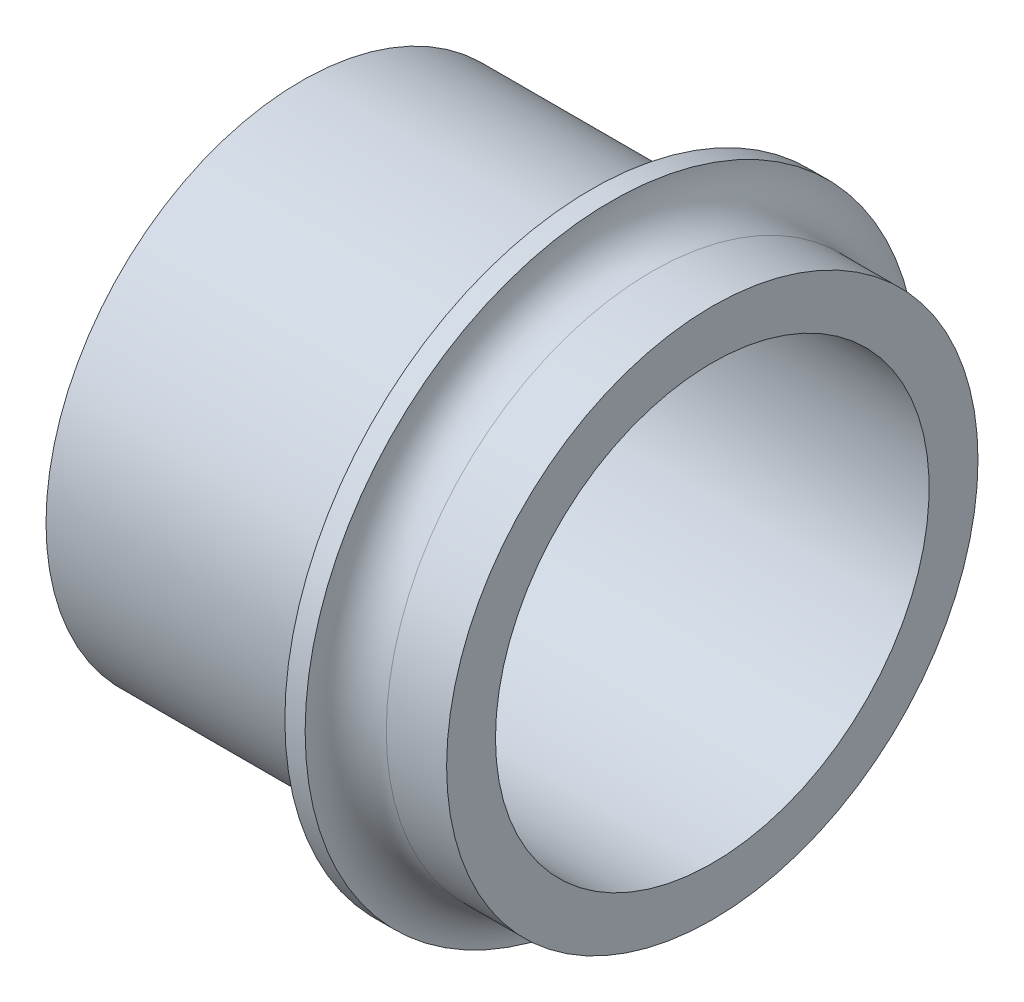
ISO-10303-21;
HEADER;
FILE_DESCRIPTION(('STEP AP214'),'2;1');
FILE_NAME('part.step','',(''),(''),'','','');
FILE_SCHEMA(('AUTOMOTIVE_DESIGN { 1 0 10303 214 1 1 1 1 }'));
ENDSEC;
DATA;
#1=APPLICATION_CONTEXT('core data for automotive mechanical design processes');
#2=APPLICATION_PROTOCOL_DEFINITION('international standard','automotive_design',2000,#1);
#3=PRODUCT_CONTEXT('',#1,'mechanical');
#4=PRODUCT('Part','Part','',(#3));
#5=PRODUCT_RELATED_PRODUCT_CATEGORY('part','',(#4));
#6=PRODUCT_DEFINITION_FORMATION('','',#4);
#7=PRODUCT_DEFINITION_CONTEXT('part definition',#1,'design');
#8=PRODUCT_DEFINITION('design','',#6,#7);
#9=PRODUCT_DEFINITION_SHAPE('','',#8);
#10=(LENGTH_UNIT() NAMED_UNIT(*) SI_UNIT(.MILLI.,.METRE.));
#11=(NAMED_UNIT(*) PLANE_ANGLE_UNIT() SI_UNIT($,.RADIAN.));
#12=(NAMED_UNIT(*) SI_UNIT($,.STERADIAN.) SOLID_ANGLE_UNIT());
#13=UNCERTAINTY_MEASURE_WITH_UNIT(LENGTH_MEASURE(1.E-05),#10,'distance_accuracy_value','');
#14=(GEOMETRIC_REPRESENTATION_CONTEXT(3) GLOBAL_UNCERTAINTY_ASSIGNED_CONTEXT((#13)) GLOBAL_UNIT_ASSIGNED_CONTEXT((#10,
#11,#12)) REPRESENTATION_CONTEXT('',''));
#15=CARTESIAN_POINT('',(0.,0.,0.));
#16=DIRECTION('',(0.,0.,1.));
#17=DIRECTION('',(1.,0.,0.));
#18=AXIS2_PLACEMENT_3D('',#15,#16,#17);
#19=CARTESIAN_POINT('',(239.842,45.71498772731,-25.62336));
#20=DIRECTION('',(-1.,0.,0.));
#21=DIRECTION('',(0.,0.,1.));
#22=AXIS2_PLACEMENT_3D('',#19,#20,#21);
#23=PLANE('',#22);
#24=CARTESIAN_POINT('',(239.842,0.,0.));
#25=DIRECTION('',(-1.,0.,0.));
#26=DIRECTION('',(0.,0.,1.));
#27=AXIS2_PLACEMENT_3D('',#24,#25,#26);
#28=CIRCLE('',#27,16.0315374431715);
#29=CARTESIAN_POINT('',(239.842,0.,16.0315374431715));
#30=VERTEX_POINT('',#29);
#31=EDGE_CURVE('E51',#30,#30,#28,.F.);
#32=ORIENTED_EDGE('',*,*,#31,.F.);
#33=EDGE_LOOP('',(#32));
#34=FACE_BOUND('',#33,.T.);
#35=CARTESIAN_POINT('',(239.842,0.,0.));
#36=DIRECTION('',(-1.,0.,0.));
#37=DIRECTION('',(0.,0.,1.));
#38=AXIS2_PLACEMENT_3D('',#35,#36,#37);
#39=CIRCLE('',#38,19.64436);
#40=CARTESIAN_POINT('',(239.842,0.,19.64436));
#41=VERTEX_POINT('',#40);
#42=EDGE_CURVE('E55',#41,#41,#39,.T.);
#43=ORIENTED_EDGE('',*,*,#42,.F.);
#44=EDGE_LOOP('',(#43));
#45=FACE_BOUND('',#44,.T.);
#46=ADVANCED_FACE('F33',(#34,#45),#23,.F.);
#47=CARTESIAN_POINT('',(209.461999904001,45.71498772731,-25.62336));
#48=DIRECTION('',(-1.,0.,0.));
#49=DIRECTION('',(0.,0.,1.));
#50=AXIS2_PLACEMENT_3D('',#47,#48,#49);
#51=PLANE('',#50);
#52=CARTESIAN_POINT('',(209.461999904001,0.,0.));
#53=DIRECTION('',(-1.,0.,0.));
#54=DIRECTION('',(0.,0.,1.));
#55=AXIS2_PLACEMENT_3D('',#52,#53,#54);
#56=CIRCLE('',#55,16.1022528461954);
#57=CARTESIAN_POINT('',(209.461999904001,0.,16.1022528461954));
#58=VERTEX_POINT('',#57);
#59=EDGE_CURVE('E49',#58,#58,#56,.F.);
#60=ORIENTED_EDGE('',*,*,#59,.T.);
#61=EDGE_LOOP('',(#60));
#62=FACE_BOUND('',#61,.T.);
#63=CARTESIAN_POINT('',(209.461999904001,0.,0.));
#64=DIRECTION('',(-1.,0.,0.));
#65=DIRECTION('',(0.,0.,1.));
#66=AXIS2_PLACEMENT_3D('',#63,#64,#65);
#67=CIRCLE('',#66,18.88236);
#68=CARTESIAN_POINT('',(209.461999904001,0.,18.88236));
#69=VERTEX_POINT('',#68);
#70=EDGE_CURVE('E37',#69,#69,#67,.T.);
#71=ORIENTED_EDGE('',*,*,#70,.T.);
#72=EDGE_LOOP('',(#71));
#73=FACE_BOUND('',#72,.T.);
#74=ADVANCED_FACE('F60',(#62,#73),#51,.T.);
#75=CARTESIAN_POINT('',(0.,0.,0.));
#76=DIRECTION('',(-1.,0.,0.));
#77=DIRECTION('',(0.,0.,1.));
#78=AXIS2_PLACEMENT_3D('',#75,#76,#77);
#79=CYLINDRICAL_SURFACE('',#78,22.64436);
#80=CARTESIAN_POINT('',(230.881999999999,0.,0.));
#81=DIRECTION('',(-1.,0.,0.));
#82=DIRECTION('',(0.,0.,1.));
#83=AXIS2_PLACEMENT_3D('',#80,#81,#82);
#84=CIRCLE('',#83,22.64436);
#85=CARTESIAN_POINT('',(230.881999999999,0.,22.64436));
#86=VERTEX_POINT('',#85);
#87=EDGE_CURVE('E41',#86,#86,#84,.T.);
#88=ORIENTED_EDGE('',*,*,#87,.F.);
#89=EDGE_LOOP('',(#88));
#90=FACE_BOUND('',#89,.T.);
#91=CARTESIAN_POINT('',(232.381999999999,0.,0.));
#92=DIRECTION('',(-1.,0.,0.));
#93=DIRECTION('',(0.,0.,1.));
#94=AXIS2_PLACEMENT_3D('',#91,#92,#93);
#95=CIRCLE('',#94,22.64436);
#96=CARTESIAN_POINT('',(232.381999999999,0.,22.64436));
#97=VERTEX_POINT('',#96);
#98=EDGE_CURVE('E46',#97,#97,#95,.T.);
#99=ORIENTED_EDGE('',*,*,#98,.T.);
#100=EDGE_LOOP('',(#99));
#101=FACE_BOUND('',#100,.T.);
#102=ADVANCED_FACE('F74',(#90,#101),#79,.T.);
#103=CARTESIAN_POINT('',(230.881999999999,0.,0.));
#104=DIRECTION('',(1.,0.,0.));
#105=DIRECTION('',(0.,0.,-1.));
#106=AXIS2_PLACEMENT_3D('',#103,#104,#105);
#107=PLANE('',#106);
#108=CARTESIAN_POINT('',(230.881999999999,0.,0.));
#109=DIRECTION('',(-1.,0.,0.));
#110=DIRECTION('',(0.,0.,1.));
#111=AXIS2_PLACEMENT_3D('',#108,#109,#110);
#112=CIRCLE('',#111,18.88236);
#113=CARTESIAN_POINT('',(230.881999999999,0.,18.88236));
#114=VERTEX_POINT('',#113);
#115=EDGE_CURVE('E10',#114,#114,#112,.T.);
#116=ORIENTED_EDGE('',*,*,#115,.F.);
#117=EDGE_LOOP('',(#116));
#118=FACE_BOUND('',#117,.T.);
#119=ORIENTED_EDGE('',*,*,#87,.T.);
#120=EDGE_LOOP('',(#119));
#121=FACE_BOUND('',#120,.T.);
#122=ADVANCED_FACE('F65',(#118,#121),#107,.F.);
#123=CARTESIAN_POINT('',(0.,0.,0.));
#124=DIRECTION('',(-1.,0.,0.));
#125=DIRECTION('',(0.,0.,1.));
#126=AXIS2_PLACEMENT_3D('',#123,#124,#125);
#127=CYLINDRICAL_SURFACE('',#126,18.88236);
#128=ORIENTED_EDGE('',*,*,#70,.F.);
#129=EDGE_LOOP('',(#128));
#130=FACE_BOUND('',#129,.T.);
#131=ORIENTED_EDGE('',*,*,#115,.T.);
#132=EDGE_LOOP('',(#131));
#133=FACE_BOUND('',#132,.T.);
#134=ADVANCED_FACE('F62',(#130,#133),#127,.T.);
#135=CARTESIAN_POINT('',(235.381999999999,0.,0.));
#136=DIRECTION('',(-1.,0.,0.));
#137=DIRECTION('',(0.,0.,1.));
#138=AXIS2_PLACEMENT_3D('',#135,#136,#137);
#139=TOROIDAL_SURFACE('',#138,22.64436,2.99999999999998);
#140=ORIENTED_EDGE('',*,*,#98,.F.);
#141=EDGE_LOOP('',(#140));
#142=FACE_BOUND('',#141,.T.);
#143=CARTESIAN_POINT('',(235.381999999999,0.,0.));
#144=DIRECTION('',(-1.,0.,0.));
#145=DIRECTION('',(0.,0.,1.));
#146=AXIS2_PLACEMENT_3D('',#143,#144,#145);
#147=CIRCLE('',#146,19.64436);
#148=CARTESIAN_POINT('',(235.381999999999,0.,19.64436));
#149=VERTEX_POINT('',#148);
#150=EDGE_CURVE('E97',#149,#149,#147,.T.);
#151=ORIENTED_EDGE('',*,*,#150,.T.);
#152=EDGE_LOOP('',(#151));
#153=FACE_BOUND('',#152,.T.);
#154=ADVANCED_FACE('F64',(#142,#153),#139,.F.);
#155=CARTESIAN_POINT('',(0.,0.,0.));
#156=DIRECTION('',(-1.,0.,0.));
#157=DIRECTION('',(0.,0.,1.));
#158=AXIS2_PLACEMENT_3D('',#155,#156,#157);
#159=CYLINDRICAL_SURFACE('',#158,19.64436);
#160=ORIENTED_EDGE('',*,*,#150,.F.);
#161=EDGE_LOOP('',(#160));
#162=FACE_BOUND('',#161,.T.);
#163=ORIENTED_EDGE('',*,*,#42,.T.);
#164=EDGE_LOOP('',(#163));
#165=FACE_BOUND('',#164,.T.);
#166=ADVANCED_FACE('F71',(#162,#165),#159,.T.);
#167=CARTESIAN_POINT('',(34.29,0.,0.));
#168=DIRECTION('',(-1.,0.,0.));
#169=DIRECTION('',(0.,0.,1.));
#170=AXIS2_PLACEMENT_3D('',#167,#168,#169);
#171=CONICAL_SURFACE('',#170,16.51,0.00232769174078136);
#172=ORIENTED_EDGE('',*,*,#31,.T.);
#173=EDGE_LOOP('',(#172));
#174=FACE_BOUND('',#173,.T.);
#175=ORIENTED_EDGE('',*,*,#59,.F.);
#176=EDGE_LOOP('',(#175));
#177=FACE_BOUND('',#176,.T.);
#178=ADVANCED_FACE('F35',(#174,#177),#171,.F.);
#179=CLOSED_SHELL('',(#46,#74,#102,#122,#134,#154,#166,#178));
#180=MANIFOLD_SOLID_BREP('B2',#179);
#181=ADVANCED_BREP_SHAPE_REPRESENTATION('',(#18,#180),#14);
#182=SHAPE_DEFINITION_REPRESENTATION(#9,#181);
ENDSEC;
END-ISO-10303-21;
